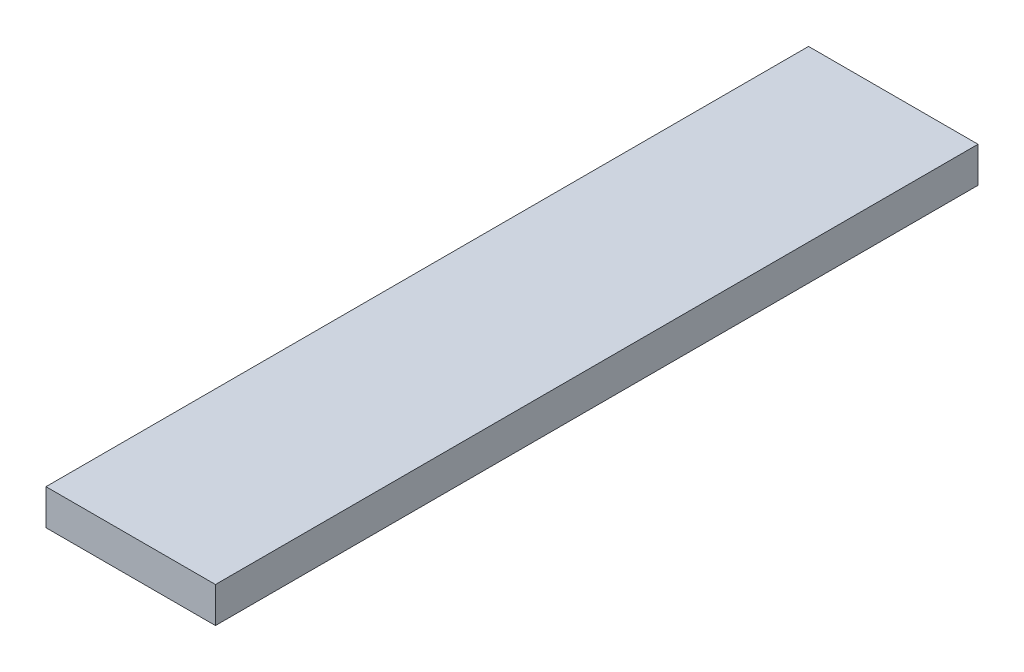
from build123d import *

# Parameters (mm, degrees)
ESQUISSE1_W      = 100
ESQUISSE1_H      = 21
EXTRUSION1_DEPTH = 450


with BuildPart() as part:
    # Esquisse1 → Extrusion1 (new body)
    with BuildSketch(Plane.XY):
        with Locations((50, -10.5)):
            Rectangle(ESQUISSE1_W, ESQUISSE1_H)
    extrude(amount=EXTRUSION1_DEPTH)


solid = part.part
